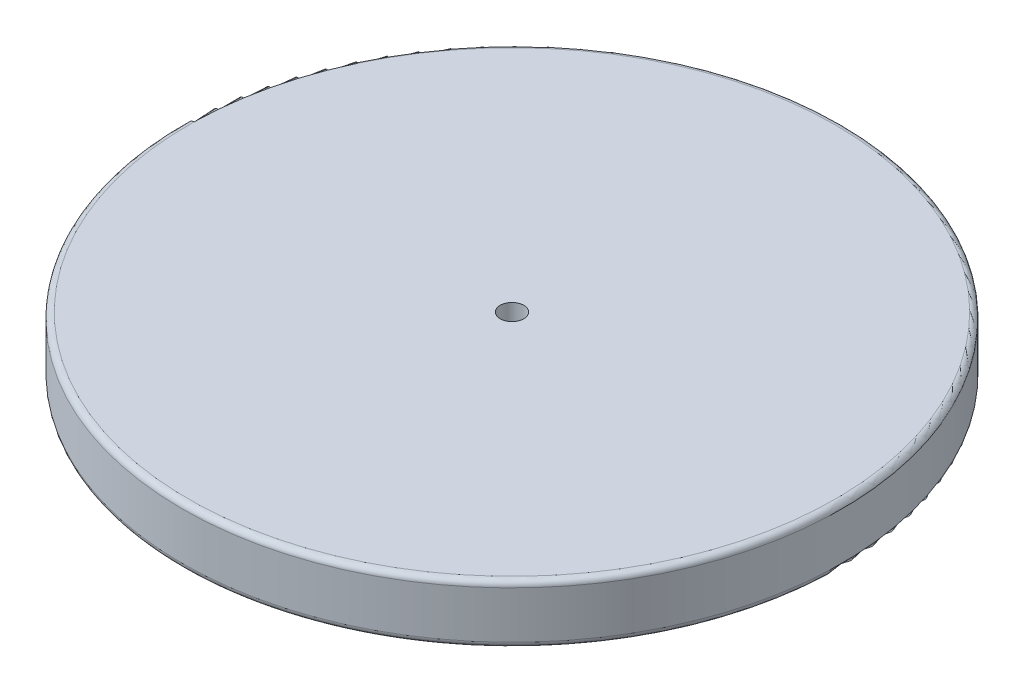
from build123d import *


with BuildPart() as part:
    # Esquisse1 → R_volution1 (revolve)
    with BuildSketch(Plane.XY, mode=Mode.PRIVATE) as r_volution1_sk:
        with BuildLine():
            Line((5, 12.5), (137.5, 12.5))
            ThreePointArc((137.5, 12.5), (139.267766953, 11.767766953), (140, 10))
            Line((140, 10), (140, -10))
            ThreePointArc((140, -10), (139.267766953, -11.767766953), (137.5, -12.5))
            Line((137.5, -12.5), (5, -12.5))
            Line((5, -12.5), (5, 12.5))
        make_face()
    revolve(r_volution1_sk.sketch.rotate(Axis((0, 0, 0), (0, 1, 0)), 90), axis=Axis((0, 0, 0), (0, 1, 0)))


solid = part.part
